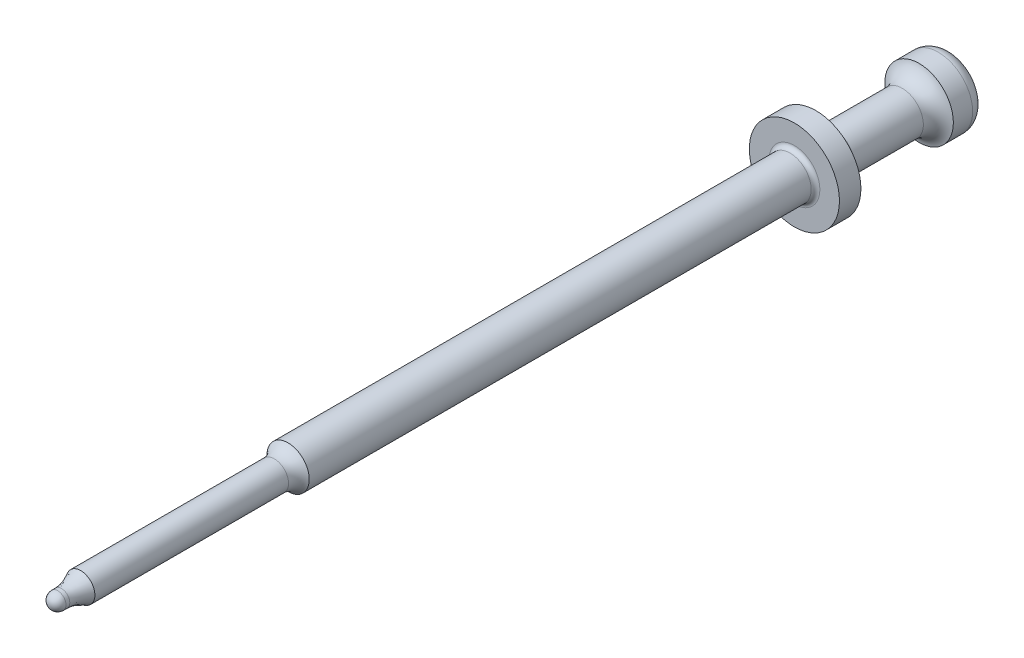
ISO-10303-21;
HEADER;
FILE_DESCRIPTION(('STEP AP214'),'2;1');
FILE_NAME('part.step','',(''),(''),'','','');
FILE_SCHEMA(('AUTOMOTIVE_DESIGN { 1 0 10303 214 1 1 1 1 }'));
ENDSEC;
DATA;
#1=APPLICATION_CONTEXT('core data for automotive mechanical design processes');
#2=APPLICATION_PROTOCOL_DEFINITION('international standard','automotive_design',2000,#1);
#3=PRODUCT_CONTEXT('',#1,'mechanical');
#4=PRODUCT('Part','Part','',(#3));
#5=PRODUCT_RELATED_PRODUCT_CATEGORY('part','',(#4));
#6=PRODUCT_DEFINITION_FORMATION('','',#4);
#7=PRODUCT_DEFINITION_CONTEXT('part definition',#1,'design');
#8=PRODUCT_DEFINITION('design','',#6,#7);
#9=PRODUCT_DEFINITION_SHAPE('','',#8);
#10=(LENGTH_UNIT() NAMED_UNIT(*) SI_UNIT(.MILLI.,.METRE.));
#11=(NAMED_UNIT(*) PLANE_ANGLE_UNIT() SI_UNIT($,.RADIAN.));
#12=(NAMED_UNIT(*) SI_UNIT($,.STERADIAN.) SOLID_ANGLE_UNIT());
#13=UNCERTAINTY_MEASURE_WITH_UNIT(LENGTH_MEASURE(1.E-05),#10,'distance_accuracy_value','');
#14=(GEOMETRIC_REPRESENTATION_CONTEXT(3) GLOBAL_UNCERTAINTY_ASSIGNED_CONTEXT((#13)) GLOBAL_UNIT_ASSIGNED_CONTEXT((#10,
#11,#12)) REPRESENTATION_CONTEXT('',''));
#15=CARTESIAN_POINT('',(0.,0.,0.));
#16=DIRECTION('',(0.,0.,1.));
#17=DIRECTION('',(1.,0.,0.));
#18=AXIS2_PLACEMENT_3D('',#15,#16,#17);
#19=CARTESIAN_POINT('',(0.,0.,82.5));
#20=DIRECTION('',(0.,-1.,0.));
#21=DIRECTION('',(1.,0.,0.));
#22=AXIS2_PLACEMENT_3D('',#19,#20,#21);
#23=SPHERICAL_SURFACE('',#22,0.765);
#24=CARTESIAN_POINT('',(0.,0.,82.5));
#25=DIRECTION('',(0.,0.,-1.));
#26=DIRECTION('',(-1.,0.,0.));
#27=AXIS2_PLACEMENT_3D('',#24,#25,#26);
#28=SPHERICAL_SURFACE('',#27,0.765);
#29=CARTESIAN_POINT('',(0.,0.,82.5));
#30=DIRECTION('',(0.,0.,-1.));
#31=DIRECTION('',(-1.,0.,0.));
#32=AXIS2_PLACEMENT_3D('',#29,#30,#31);
#33=CIRCLE('',#32,0.765);
#34=CARTESIAN_POINT('',(-0.765,0.,82.5));
#35=VERTEX_POINT('',#34);
#36=EDGE_CURVE('E11',#35,#35,#33,.T.);
#37=ORIENTED_EDGE('',*,*,#36,.F.);
#38=EDGE_LOOP('',(#37));
#39=FACE_BOUND('',#38,.T.);
#40=ADVANCED_FACE('F61',(#39),#28,.T.);
#41=CARTESIAN_POINT('',(0.,0.,14.49));
#42=DIRECTION('',(0.,0.,1.));
#43=DIRECTION('',(1.,0.,0.));
#44=AXIS2_PLACEMENT_3D('',#41,#42,#43);
#45=PLANE('',#44);
#46=CARTESIAN_POINT('',(0.,0.,14.49));
#47=DIRECTION('',(0.,0.,1.));
#48=DIRECTION('',(1.,0.,0.));
#49=AXIS2_PLACEMENT_3D('',#46,#47,#48);
#50=CIRCLE('',#49,2.35);
#51=CARTESIAN_POINT('',(2.35,0.,14.49));
#52=VERTEX_POINT('',#51);
#53=EDGE_CURVE('E71',#52,#52,#50,.F.);
#54=ORIENTED_EDGE('',*,*,#53,.T.);
#55=EDGE_LOOP('',(#54));
#56=FACE_BOUND('',#55,.T.);
#57=CARTESIAN_POINT('',(0.,0.,14.49));
#58=DIRECTION('',(0.,0.,1.));
#59=DIRECTION('',(1.,0.,0.));
#60=AXIS2_PLACEMENT_3D('',#57,#58,#59);
#61=CIRCLE('',#60,4.16);
#62=CARTESIAN_POINT('',(4.16,0.,14.49));
#63=VERTEX_POINT('',#62);
#64=EDGE_CURVE('E309',#63,#63,#61,.T.);
#65=ORIENTED_EDGE('',*,*,#64,.T.);
#66=EDGE_LOOP('',(#65));
#67=FACE_BOUND('',#66,.T.);
#68=ADVANCED_FACE('F121',(#56,#67),#45,.T.);
#69=CARTESIAN_POINT('',(0.,0.,2.98));
#70=DIRECTION('',(0.,0.,-1.));
#71=DIRECTION('',(-1.,0.,0.));
#72=AXIS2_PLACEMENT_3D('',#69,#70,#71);
#73=CYLINDRICAL_SURFACE('',#72,3.165);
#74=CARTESIAN_POINT('',(0.,0.,1.2));
#75=DIRECTION('',(0.,0.,1.));
#76=DIRECTION('',(1.,0.,0.));
#77=AXIS2_PLACEMENT_3D('',#74,#75,#76);
#78=CIRCLE('',#77,3.165);
#79=CARTESIAN_POINT('',(3.165,0.,1.2));
#80=VERTEX_POINT('',#79);
#81=EDGE_CURVE('E83',#80,#80,#78,.T.);
#82=ORIENTED_EDGE('',*,*,#81,.T.);
#83=EDGE_LOOP('',(#82));
#84=FACE_BOUND('',#83,.T.);
#85=CARTESIAN_POINT('',(0.,0.,2.98));
#86=DIRECTION('',(0.,0.,1.));
#87=DIRECTION('',(1.,0.,0.));
#88=AXIS2_PLACEMENT_3D('',#85,#86,#87);
#89=CIRCLE('',#88,3.165);
#90=CARTESIAN_POINT('',(3.165,0.,2.98));
#91=VERTEX_POINT('',#90);
#92=EDGE_CURVE('E95',#91,#91,#89,.T.);
#93=ORIENTED_EDGE('',*,*,#92,.F.);
#94=EDGE_LOOP('',(#93));
#95=FACE_BOUND('',#94,.T.);
#96=ADVANCED_FACE('F124',(#84,#95),#73,.T.);
#97=CARTESIAN_POINT('',(0.,0.,0.));
#98=DIRECTION('',(0.,0.,1.));
#99=DIRECTION('',(1.,0.,0.));
#100=AXIS2_PLACEMENT_3D('',#97,#98,#99);
#101=PLANE('',#100);
#102=CARTESIAN_POINT('',(0.,0.,0.));
#103=DIRECTION('',(0.,0.,1.));
#104=DIRECTION('',(1.,0.,0.));
#105=AXIS2_PLACEMENT_3D('',#102,#103,#104);
#106=CIRCLE('',#105,1.965);
#107=CARTESIAN_POINT('',(1.965,0.,0.));
#108=VERTEX_POINT('',#107);
#109=EDGE_CURVE('E80',#108,#108,#106,.F.);
#110=ORIENTED_EDGE('',*,*,#109,.T.);
#111=EDGE_LOOP('',(#110));
#112=FACE_BOUND('',#111,.T.);
#113=ADVANCED_FACE('F136',(#112),#101,.F.);
#114=CARTESIAN_POINT('',(0.,0.,12.51));
#115=DIRECTION('',(0.,0.,-1.));
#116=DIRECTION('',(-1.,0.,0.));
#117=AXIS2_PLACEMENT_3D('',#114,#115,#116);
#118=CYLINDRICAL_SURFACE('',#117,1.95);
#119=CARTESIAN_POINT('',(0.,0.,4.53298905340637));
#120=DIRECTION('',(0.,0.,-1.));
#121=DIRECTION('',(-1.,0.,0.));
#122=AXIS2_PLACEMENT_3D('',#119,#120,#121);
#123=CIRCLE('',#122,1.95);
#124=CARTESIAN_POINT('',(-1.95,0.,4.53298905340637));
#125=VERTEX_POINT('',#124);
#126=EDGE_CURVE('E89',#125,#125,#123,.F.);
#127=ORIENTED_EDGE('',*,*,#126,.T.);
#128=EDGE_LOOP('',(#127));
#129=FACE_BOUND('',#128,.T.);
#130=CARTESIAN_POINT('',(0.,0.,10.91));
#131=DIRECTION('',(0.,0.,1.));
#132=DIRECTION('',(1.,0.,0.));
#133=AXIS2_PLACEMENT_3D('',#130,#131,#132);
#134=CIRCLE('',#133,1.95);
#135=CARTESIAN_POINT('',(1.95,0.,10.91));
#136=VERTEX_POINT('',#135);
#137=EDGE_CURVE('E92',#136,#136,#134,.F.);
#138=ORIENTED_EDGE('',*,*,#137,.T.);
#139=EDGE_LOOP('',(#138));
#140=FACE_BOUND('',#139,.T.);
#141=ADVANCED_FACE('F129',(#129,#140),#118,.T.);
#142=CARTESIAN_POINT('',(0.,0.,12.51));
#143=DIRECTION('',(0.,0.,1.));
#144=DIRECTION('',(1.,0.,0.));
#145=AXIS2_PLACEMENT_3D('',#142,#143,#144);
#146=PLANE('',#145);
#147=CARTESIAN_POINT('',(0.,0.,12.51));
#148=DIRECTION('',(0.,0.,1.));
#149=DIRECTION('',(1.,0.,0.));
#150=AXIS2_PLACEMENT_3D('',#147,#148,#149);
#151=CIRCLE('',#150,3.55);
#152=CARTESIAN_POINT('',(3.55,0.,12.51));
#153=VERTEX_POINT('',#152);
#154=EDGE_CURVE('E86',#153,#153,#151,.T.);
#155=ORIENTED_EDGE('',*,*,#154,.T.);
#156=EDGE_LOOP('',(#155));
#157=FACE_BOUND('',#156,.T.);
#158=CARTESIAN_POINT('',(0.,0.,12.51));
#159=DIRECTION('',(0.,0.,1.));
#160=DIRECTION('',(1.,0.,0.));
#161=AXIS2_PLACEMENT_3D('',#158,#159,#160);
#162=CIRCLE('',#161,4.16);
#163=CARTESIAN_POINT('',(4.16,0.,12.51));
#164=VERTEX_POINT('',#163);
#165=EDGE_CURVE('E308',#164,#164,#162,.T.);
#166=ORIENTED_EDGE('',*,*,#165,.F.);
#167=EDGE_LOOP('',(#166));
#168=FACE_BOUND('',#167,.T.);
#169=ADVANCED_FACE('F126',(#157,#168),#146,.F.);
#170=CARTESIAN_POINT('',(0.,0.,14.49));
#171=DIRECTION('',(0.,0.,-1.));
#172=DIRECTION('',(-1.,0.,0.));
#173=AXIS2_PLACEMENT_3D('',#170,#171,#172);
#174=CYLINDRICAL_SURFACE('',#173,4.16);
#175=ORIENTED_EDGE('',*,*,#64,.F.);
#176=EDGE_LOOP('',(#175));
#177=FACE_BOUND('',#176,.T.);
#178=ORIENTED_EDGE('',*,*,#165,.T.);
#179=EDGE_LOOP('',(#178));
#180=FACE_BOUND('',#179,.T.);
#181=ADVANCED_FACE('F119',(#177,#180),#174,.T.);
#182=CARTESIAN_POINT('',(0.,0.,61.23));
#183=DIRECTION('',(0.,0.,-1.));
#184=DIRECTION('',(-1.,0.,0.));
#185=AXIS2_PLACEMENT_3D('',#182,#183,#184);
#186=CYLINDRICAL_SURFACE('',#185,1.95);
#187=CARTESIAN_POINT('',(0.,0.,14.89));
#188=DIRECTION('',(0.,0.,1.));
#189=DIRECTION('',(1.,0.,0.));
#190=AXIS2_PLACEMENT_3D('',#187,#188,#189);
#191=CIRCLE('',#190,1.95);
#192=CARTESIAN_POINT('',(1.95,0.,14.89));
#193=VERTEX_POINT('',#192);
#194=EDGE_CURVE('E75',#193,#193,#191,.T.);
#195=ORIENTED_EDGE('',*,*,#194,.T.);
#196=EDGE_LOOP('',(#195));
#197=FACE_BOUND('',#196,.T.);
#198=CARTESIAN_POINT('',(0.,0.,61.23));
#199=DIRECTION('',(0.,0.,1.));
#200=DIRECTION('',(1.,0.,0.));
#201=AXIS2_PLACEMENT_3D('',#198,#199,#200);
#202=CIRCLE('',#201,1.95);
#203=CARTESIAN_POINT('',(1.95,0.,61.23));
#204=VERTEX_POINT('',#203);
#205=EDGE_CURVE('E104',#204,#204,#202,.T.);
#206=ORIENTED_EDGE('',*,*,#205,.F.);
#207=EDGE_LOOP('',(#206));
#208=FACE_BOUND('',#207,.T.);
#209=ADVANCED_FACE('F116',(#197,#208),#186,.T.);
#210=CARTESIAN_POINT('',(0.,0.,80.38));
#211=DIRECTION('',(0.,0.,-1.));
#212=DIRECTION('',(-1.,0.,0.));
#213=AXIS2_PLACEMENT_3D('',#210,#211,#212);
#214=CYLINDRICAL_SURFACE('',#213,1.315);
#215=CARTESIAN_POINT('',(0.,0.,62.5062346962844));
#216=DIRECTION('',(0.,0.,-1.));
#217=DIRECTION('',(-1.,0.,0.));
#218=AXIS2_PLACEMENT_3D('',#215,#216,#217);
#219=CIRCLE('',#218,1.315);
#220=CARTESIAN_POINT('',(-1.315,0.,62.5062346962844));
#221=VERTEX_POINT('',#220);
#222=EDGE_CURVE('E67',#221,#221,#219,.F.);
#223=ORIENTED_EDGE('',*,*,#222,.T.);
#224=EDGE_LOOP('',(#223));
#225=FACE_BOUND('',#224,.T.);
#226=CARTESIAN_POINT('',(-0.914531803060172,-0.944910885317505,80.38));
#227=CARTESIAN_POINT('',(-0.960591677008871,-0.900330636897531,80.3799991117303));
#228=CARTESIAN_POINT('',(-1.00339430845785,-0.852368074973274,80.3801715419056));
#229=CARTESIAN_POINT('',(-1.08157394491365,-0.750693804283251,80.3804378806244));
#230=CARTESIAN_POINT('',(-1.11694576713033,-0.696978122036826,80.3805317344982));
#231=CARTESIAN_POINT('',(-1.18424180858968,-0.576414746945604,80.3805341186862));
#232=CARTESIAN_POINT('',(-1.21482421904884,-0.508812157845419,80.3804123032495));
#233=CARTESIAN_POINT('',(-1.26420851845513,-0.369422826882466,80.3800721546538));
#234=CARTESIAN_POINT('',(-1.28300709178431,-0.297634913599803,80.3798537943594));
#235=CARTESIAN_POINT('',(-1.30828496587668,-0.151926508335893,80.3795444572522));
#236=CARTESIAN_POINT('',(-1.31476543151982,-0.0780062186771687,80.3794534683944));
#237=CARTESIAN_POINT('',(-1.31522198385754,0.0698701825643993,80.379483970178));
#238=CARTESIAN_POINT('',(-1.30919883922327,0.143826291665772,80.3796054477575));
#239=CARTESIAN_POINT('',(-1.28482969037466,0.289666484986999,80.3799467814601));
#240=CARTESIAN_POINT('',(-1.26648410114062,0.361550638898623,80.3801666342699));
#241=CARTESIAN_POINT('',(-1.21796156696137,0.501252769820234,80.3804724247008));
#242=CARTESIAN_POINT('',(-1.18778451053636,0.569070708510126,80.38055836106));
#243=CARTESIAN_POINT('',(-1.13435246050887,0.666215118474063,80.3805069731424));
#244=CARTESIAN_POINT('',(-1.11516989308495,0.697846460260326,80.3804597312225));
#245=CARTESIAN_POINT('',(-1.07420465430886,0.759390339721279,80.3803296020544));
#246=CARTESIAN_POINT('',(-1.05242198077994,0.789302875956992,80.3802467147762));
#247=CARTESIAN_POINT('',(-1.00641505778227,0.847184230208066,80.3800911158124));
#248=CARTESIAN_POINT('',(-0.982190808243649,0.875153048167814,80.3800184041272));
#249=CARTESIAN_POINT('',(-0.931472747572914,0.928951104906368,80.3799902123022));
#250=CARTESIAN_POINT('',(-0.904978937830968,0.954780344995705,80.3800347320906));
#251=CARTESIAN_POINT('',(-0.849907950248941,1.00411526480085,80.3801669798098));
#252=CARTESIAN_POINT('',(-0.821330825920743,1.02762100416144,80.3802547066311));
#253=CARTESIAN_POINT('',(-0.762307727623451,1.07213825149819,80.3804043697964));
#254=CARTESIAN_POINT('',(-0.731861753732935,1.09314975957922,80.3804663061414));
#255=CARTESIAN_POINT('',(-0.638032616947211,1.15221006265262,80.3805661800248));
#256=CARTESIAN_POINT('',(-0.572108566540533,1.18632905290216,80.3805184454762));
#257=CARTESIAN_POINT('',(-0.435503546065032,1.24299550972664,80.3802558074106));
#258=CARTESIAN_POINT('',(-0.364822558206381,1.26554293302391,80.3800409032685));
#259=CARTESIAN_POINT('',(-0.220668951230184,1.29845778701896,80.3796771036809));
#260=CARTESIAN_POINT('',(-0.147196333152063,1.30882522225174,80.379528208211));
#261=CARTESIAN_POINT('',(0.000448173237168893,1.31707747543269,80.3794377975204));
#262=CARTESIAN_POINT('',(0.0746200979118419,1.31496164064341,80.3794962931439));
#263=CARTESIAN_POINT('',(0.221556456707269,1.2983082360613,80.3797656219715));
#264=CARTESIAN_POINT('',(0.294320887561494,1.28377063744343,80.3799764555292));
#265=CARTESIAN_POINT('',(0.436374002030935,1.24268636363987,80.3803417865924));
#266=CARTESIAN_POINT('',(0.505662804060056,1.21614009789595,80.3804962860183));
#267=CARTESIAN_POINT('',(0.638800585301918,1.15179223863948,80.380554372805));
#268=CARTESIAN_POINT('',(0.7026495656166,1.11399064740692,80.3804579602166));
#269=CARTESIAN_POINT('',(0.823092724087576,1.0282069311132,80.3801722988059));
#270=CARTESIAN_POINT('',(0.879687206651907,0.980225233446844,80.3799830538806));
#271=CARTESIAN_POINT('',(0.984018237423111,0.875442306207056,80.3800337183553));
#272=CARTESIAN_POINT('',(1.03175478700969,0.818641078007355,80.3802736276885));
#273=CARTESIAN_POINT('',(1.11701638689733,0.697829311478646,80.3805403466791));
#274=CARTESIAN_POINT('',(1.15454117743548,0.633818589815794,80.3805671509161));
#275=CARTESIAN_POINT('',(1.2183123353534,0.500406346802,80.3804091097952));
#276=CARTESIAN_POINT('',(1.24455869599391,0.431004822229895,80.3802242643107));
#277=CARTESIAN_POINT('',(1.28502762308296,0.288781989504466,80.3798467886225));
#278=CARTESIAN_POINT('',(1.29925044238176,0.215960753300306,80.3796541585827));
#279=CARTESIAN_POINT('',(1.31527008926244,0.0689644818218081,80.3794512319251));
#280=CARTESIAN_POINT('',(1.31706694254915,-0.00521055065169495,80.3794409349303));
#281=CARTESIAN_POINT('',(1.30818133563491,-0.152813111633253,80.3796116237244));
#282=CARTESIAN_POINT('',(1.29749861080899,-0.226240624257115,80.3797926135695));
#283=CARTESIAN_POINT('',(1.26396517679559,-0.370251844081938,80.3801716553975));
#284=CARTESIAN_POINT('',(1.24111447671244,-0.440835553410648,80.3803697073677));
#285=CARTESIAN_POINT('',(1.18386036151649,-0.577200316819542,80.3805574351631));
#286=CARTESIAN_POINT('',(1.14945630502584,-0.642981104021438,80.380547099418));
#287=CARTESIAN_POINT('',(1.08998900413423,-0.736560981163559,80.3803863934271));
#288=CARTESIAN_POINT('',(1.06884518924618,-0.766918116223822,80.3803085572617));
#289=CARTESIAN_POINT('',(1.02407167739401,-0.825752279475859,80.3801467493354));
#290=CARTESIAN_POINT('',(1.00044198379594,-0.85422931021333,80.380062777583));
#291=CARTESIAN_POINT('',(0.950867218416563,-0.909089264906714,80.3799912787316));
#292=CARTESIAN_POINT('',(0.924922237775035,-0.935472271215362,80.380003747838));
#293=CARTESIAN_POINT('',(0.870911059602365,-0.985955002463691,80.3801050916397));
#294=CARTESIAN_POINT('',(0.842844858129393,-1.01005472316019,80.3801939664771));
#295=CARTESIAN_POINT('',(0.755750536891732,-1.07866362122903,80.3804285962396));
#296=CARTESIAN_POINT('',(0.693781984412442,-1.11953192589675,80.3805425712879));
#297=CARTESIAN_POINT('',(0.563896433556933,-1.19026135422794,80.3805209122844));
#298=CARTESIAN_POINT('',(0.495979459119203,-1.22012252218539,80.3803852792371));
#299=CARTESIAN_POINT('',(0.356089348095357,-1.26802513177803,80.380033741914));
#300=CARTESIAN_POINT('',(0.284116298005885,-1.28606682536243,80.3798178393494));
#301=CARTESIAN_POINT('',(0.138166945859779,-1.3098100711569,80.3795236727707));
#302=CARTESIAN_POINT('',(0.0641906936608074,-1.31551193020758,80.3794454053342));
#303=CARTESIAN_POINT('',(-0.0836816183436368,-1.314415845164,80.3795000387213));
#304=CARTESIAN_POINT('',(-0.157577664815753,-1.30761607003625,80.3796329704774));
#305=CARTESIAN_POINT('',(-0.30319062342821,-1.28170673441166,80.3799843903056));
#306=CARTESIAN_POINT('',(-0.374907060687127,-1.26259451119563,80.3802028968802));
#307=CARTESIAN_POINT('',(-0.514077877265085,-1.21260362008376,80.3804930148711));
#308=CARTESIAN_POINT('',(-0.581535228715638,-1.18173326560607,80.3805647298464));
#309=CARTESIAN_POINT('',(-0.694717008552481,-1.11791777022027,80.3804792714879));
#310=CARTESIAN_POINT('',(-0.741756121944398,-1.08727341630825,80.3803731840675));
#311=CARTESIAN_POINT('',(-0.831535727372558,-1.0202494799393,80.380133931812));
#312=CARTESIAN_POINT('',(-0.874277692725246,-0.983871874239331,80.3800007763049));
#313=CARTESIAN_POINT('',(-0.914531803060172,-0.944910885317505,80.38));
#314=B_SPLINE_CURVE_WITH_KNOTS('',3,(#226,#227,#228,#229,#230,#231,#232,#233,#234,#235,#236,
#237,#238,#239,#240,#241,#242,#243,#244,#245,#246,#247,#248,#249,#250,#251,#252,#253,#254,#255,
#256,#257,#258,#259,#260,#261,#262,#263,#264,#265,#266,#267,#268,#269,#270,#271,#272,#273,#274,
#275,#276,#277,#278,#279,#280,#281,#282,#283,#284,#285,#286,#287,#288,#289,#290,#291,#292,#293,
#294,#295,#296,#297,#298,#299,#300,#301,#302,#303,#304,#305,#306,#307,#308,#309,#310,#311,#312,
#313),.UNSPECIFIED.,.T.,.F.,(4,2,2,2,2,2,2,2,2,2,2,2,2,2,2,2,2,2,2,2,2,2,2,2,2,2,2,2,2,2,2,2,2,
2,2,2,2,2,2,2,2,2,2,4),(0.,0.192148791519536,0.384431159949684,0.605947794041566,
0.827526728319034,1.04908470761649,1.27062906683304,1.49216596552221,1.71370495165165,
1.82457745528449,1.9354500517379,2.04632265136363,2.15719518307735,2.26806486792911,
2.37893454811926,2.60047652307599,2.82201932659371,3.04356204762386,3.26511635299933,
3.48667117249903,3.70821843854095,3.9297656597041,4.15130358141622,4.37284146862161,
4.59438499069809,4.81592864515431,5.03746764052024,5.25900617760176,5.4805494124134,
5.70209248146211,5.92364785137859,6.03452441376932,6.14540082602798,6.25627287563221,
6.36714513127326,6.58869228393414,6.81023854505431,7.03178008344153,7.25331611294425,
7.47488459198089,7.69650100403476,7.91796101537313,8.08594759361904,8.25387637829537),.UNSPECIFIED.);
#315=CARTESIAN_POINT('',(0.914531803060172,0.944910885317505,80.38));
#316=VERTEX_POINT('',#315);
#317=EDGE_CURVE('E96',#316,#316,#314,.F.);
#318=ORIENTED_EDGE('',*,*,#317,.F.);
#319=EDGE_LOOP('',(#318));
#320=FACE_BOUND('',#319,.T.);
#321=ADVANCED_FACE('F112',(#225,#320),#214,.T.);
#322=CARTESIAN_POINT('',(0.455082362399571,0.61491872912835,82.15));
#323=CARTESIAN_POINT('',(0.455082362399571,0.61491872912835,81.5306016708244));
#324=CARTESIAN_POINT('',(0.684807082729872,0.779914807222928,80.9553008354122));
#325=CARTESIAN_POINT('',(0.914531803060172,0.944910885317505,80.38));
#326=CARTESIAN_POINT('',(0.916829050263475,0.946560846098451,80.3742469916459));
#327=CARTESIAN_POINT('',(0.919126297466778,0.948210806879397,80.3684939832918));
#328=CARTESIAN_POINT('',(0.921423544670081,0.949860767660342,80.3627409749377));
#329=CARTESIAN_POINT('',(0.47205150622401,0.602360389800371,82.15));
#330=CARTESIAN_POINT('',(0.47205150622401,0.602360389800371,81.5306016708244));
#331=CARTESIAN_POINT('',(0.706329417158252,0.761017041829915,80.9553008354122));
#332=CARTESIAN_POINT('',(0.940607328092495,0.919673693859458,80.38));
#333=CARTESIAN_POINT('',(0.942950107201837,0.921260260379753,80.3742469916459));
#334=CARTESIAN_POINT('',(0.945292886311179,0.922846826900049,80.3684939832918));
#335=CARTESIAN_POINT('',(0.947635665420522,0.924433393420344,80.3627409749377));
#336=CARTESIAN_POINT('',(0.504650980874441,0.576102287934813,82.15));
#337=CARTESIAN_POINT('',(0.504650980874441,0.576102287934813,81.5305992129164));
#338=CARTESIAN_POINT('',(0.747434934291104,0.721829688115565,80.9552996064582));
#339=CARTESIAN_POINT('',(0.990218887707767,0.867557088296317,80.38));
#340=CARTESIAN_POINT('',(0.992646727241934,0.869014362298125,80.3742470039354));
#341=CARTESIAN_POINT('',(0.9950745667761,0.870471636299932,80.3684940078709));
#342=CARTESIAN_POINT('',(0.997502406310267,0.87192891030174,80.3627410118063));
#343=CARTESIAN_POINT('',(0.549492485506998,0.533567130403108,82.15));
#344=CARTESIAN_POINT('',(0.549492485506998,0.533567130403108,81.5305940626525));
#345=CARTESIAN_POINT('',(0.803251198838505,0.659251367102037,80.9552970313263));
#346=CARTESIAN_POINT('',(1.05700991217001,0.784935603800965,80.38));
#347=CARTESIAN_POINT('',(1.05954749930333,0.786192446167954,80.3742470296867));
#348=CARTESIAN_POINT('',(1.06208508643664,0.787449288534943,80.3684940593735));
#349=CARTESIAN_POINT('',(1.06462267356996,0.788706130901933,80.3627410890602));
#350=CARTESIAN_POINT('',(0.590235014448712,0.48816023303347,82.15));
#351=CARTESIAN_POINT('',(0.590235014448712,0.48816023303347,81.5305904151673));
#352=CARTESIAN_POINT('',(0.853200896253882,0.593253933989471,80.9552952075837));
#353=CARTESIAN_POINT('',(1.11616677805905,0.698347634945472,80.38));
#354=CARTESIAN_POINT('',(1.1187964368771,0.699398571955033,80.3742470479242));
#355=CARTESIAN_POINT('',(1.12142609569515,0.700449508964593,80.3684940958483));
#356=CARTESIAN_POINT('',(1.12405575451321,0.701500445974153,80.3627411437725));
#357=CARTESIAN_POINT('',(0.809848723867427,0.200145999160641,82.15));
#358=CARTESIAN_POINT('',(0.809848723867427,0.200145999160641,81.5305914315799));
#359=CARTESIAN_POINT('',(1.1175523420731,0.179023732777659,80.95529571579));
#360=CARTESIAN_POINT('',(1.42525596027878,0.157901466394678,80.38));
#361=CARTESIAN_POINT('',(1.42833299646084,0.157690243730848,80.3742470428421));
#362=CARTESIAN_POINT('',(1.4314100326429,0.157479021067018,80.3684940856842));
#363=CARTESIAN_POINT('',(1.43448706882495,0.157267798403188,80.3627411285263));
#364=CARTESIAN_POINT('',(0.81585215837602,-0.183576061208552,82.15));
#365=CARTESIAN_POINT('',(0.81585215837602,-0.183576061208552,81.5305989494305));
#366=CARTESIAN_POINT('',(1.08227905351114,-0.34044973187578,80.9552994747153));
#367=CARTESIAN_POINT('',(1.34870594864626,-0.497323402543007,80.38));
#368=CARTESIAN_POINT('',(1.35137021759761,-0.49889213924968,80.3742470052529));
#369=CARTESIAN_POINT('',(1.35403448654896,-0.500460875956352,80.3684940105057));
#370=CARTESIAN_POINT('',(1.35669875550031,-0.502029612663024,80.3627410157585));
#371=CARTESIAN_POINT('',(0.363751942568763,-0.794465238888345,82.15));
#372=CARTESIAN_POINT('',(0.363751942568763,-0.794465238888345,81.5306050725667));
#373=CARTESIAN_POINT('',(0.401959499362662,-1.11525377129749,80.9553025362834));
#374=CARTESIAN_POINT('',(0.44016705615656,-1.43604230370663,80.38));
#375=CARTESIAN_POINT('',(0.440549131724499,-1.43925018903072,80.3742469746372));
#376=CARTESIAN_POINT('',(0.440931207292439,-1.44245807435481,80.3684939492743));
#377=CARTESIAN_POINT('',(0.441313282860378,-1.4456659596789,80.3627409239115));
#378=CARTESIAN_POINT('',(-0.115699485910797,-0.866085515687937,82.15));
#379=CARTESIAN_POINT('',(-0.115699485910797,-0.866085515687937,81.5306016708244));
#380=CARTESIAN_POINT('',(-0.254360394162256,-1.15787011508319,80.9553008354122));
#381=CARTESIAN_POINT('',(-0.393021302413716,-1.44965471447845,80.38));
#382=CARTESIAN_POINT('',(-0.39440791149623,-1.4525725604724,80.3742469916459));
#383=CARTESIAN_POINT('',(-0.395794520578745,-1.45549040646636,80.3684939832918));
#384=CARTESIAN_POINT('',(-0.397181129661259,-1.45840825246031,80.3627409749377));
#385=CARTESIAN_POINT('',(-0.794465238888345,-0.363751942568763,82.15));
#386=CARTESIAN_POINT('',(-0.794465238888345,-0.363751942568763,81.5306016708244));
#387=CARTESIAN_POINT('',(-1.11525377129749,-0.401959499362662,80.9553008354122));
#388=CARTESIAN_POINT('',(-1.43604230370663,-0.44016705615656,80.38));
#389=CARTESIAN_POINT('',(-1.43925018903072,-0.440549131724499,80.3742469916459));
#390=CARTESIAN_POINT('',(-1.44245807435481,-0.440931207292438,80.3684939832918));
#391=CARTESIAN_POINT('',(-1.4456659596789,-0.441313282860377,80.3627409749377));
#392=CARTESIAN_POINT('',(-0.866085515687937,0.115699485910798,82.15));
#393=CARTESIAN_POINT('',(-0.866085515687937,0.115699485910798,81.5306050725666));
#394=CARTESIAN_POINT('',(-1.15787011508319,0.254360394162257,80.9553025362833));
#395=CARTESIAN_POINT('',(-1.44965471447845,0.393021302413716,80.38));
#396=CARTESIAN_POINT('',(-1.4525725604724,0.394407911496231,80.3742469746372));
#397=CARTESIAN_POINT('',(-1.45549040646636,0.395794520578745,80.3684939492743));
#398=CARTESIAN_POINT('',(-1.45840825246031,0.39718112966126,80.3627409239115));
#399=CARTESIAN_POINT('',(-0.413985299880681,0.72658866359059,82.15));
#400=CARTESIAN_POINT('',(-0.413985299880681,0.72658866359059,81.5305989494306));
#401=CARTESIAN_POINT('',(-0.477550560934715,1.02916443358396,80.9552994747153));
#402=CARTESIAN_POINT('',(-0.541115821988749,1.33174020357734,80.38));
#403=CARTESIAN_POINT('',(-0.54175147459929,1.33476596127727,80.3742470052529));
#404=CARTESIAN_POINT('',(-0.54238712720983,1.3377917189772,80.3684940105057));
#405=CARTESIAN_POINT('',(-0.54302277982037,1.34081747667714,80.3627410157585));
#406=CARTESIAN_POINT('',(-0.0452599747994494,0.832985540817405,82.15));
#407=CARTESIAN_POINT('',(-0.0452599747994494,0.832985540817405,81.5305914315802));
#408=CARTESIAN_POINT('',(0.0329993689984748,1.13131948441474,80.9552957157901));
#409=CARTESIAN_POINT('',(0.111258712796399,1.42965342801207,80.38));
#410=CARTESIAN_POINT('',(0.112041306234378,1.43263676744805,80.3742470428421));
#411=CARTESIAN_POINT('',(0.112823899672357,1.43562010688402,80.3684940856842));
#412=CARTESIAN_POINT('',(0.113606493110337,1.43860344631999,80.3627411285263));
#413=CARTESIAN_POINT('',(0.294360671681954,0.707127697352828,82.15));
#414=CARTESIAN_POINT('',(0.294360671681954,0.707127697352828,81.5305904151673));
#415=CARTESIAN_POINT('',(0.477937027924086,0.922755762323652,80.9552952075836));
#416=CARTESIAN_POINT('',(0.661513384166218,1.13838382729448,80.38));
#417=CARTESIAN_POINT('',(0.663349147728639,1.14054010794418,80.3742470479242));
#418=CARTESIAN_POINT('',(0.66518491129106,1.14269638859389,80.3684940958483));
#419=CARTESIAN_POINT('',(0.667020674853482,1.1448526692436,80.3627411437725));
#420=CARTESIAN_POINT('',(0.349691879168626,0.681433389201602,82.15));
#421=CARTESIAN_POINT('',(0.349691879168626,0.681433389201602,81.5305940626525));
#422=CARTESIAN_POINT('',(0.549839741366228,0.881760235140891,80.9552970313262));
#423=CARTESIAN_POINT('',(0.74998760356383,1.08208708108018,80.38));
#424=CARTESIAN_POINT('',(0.751989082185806,1.08409034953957,80.3742470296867));
#425=CARTESIAN_POINT('',(0.753990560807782,1.08609361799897,80.3684940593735));
#426=CARTESIAN_POINT('',(0.755992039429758,1.08809688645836,80.3627410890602));
#427=CARTESIAN_POINT('',(0.403474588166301,0.650979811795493,82.15));
#428=CARTESIAN_POINT('',(0.403474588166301,0.650979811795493,81.5305992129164));
#429=CARTESIAN_POINT('',(0.619110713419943,0.834505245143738,80.9552996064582));
#430=CARTESIAN_POINT('',(0.834746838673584,1.01803067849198,80.38));
#431=CARTESIAN_POINT('',(0.836903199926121,1.01986593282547,80.3742470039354));
#432=CARTESIAN_POINT('',(0.839059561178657,1.02170118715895,80.3684940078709));
#433=CARTESIAN_POINT('',(0.841215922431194,1.02353644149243,80.3627410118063));
#434=CARTESIAN_POINT('',(0.438113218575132,0.62747706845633,82.15));
#435=CARTESIAN_POINT('',(0.438113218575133,0.62747706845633,81.5306016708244));
#436=CARTESIAN_POINT('',(0.663284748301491,0.798812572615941,80.9553008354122));
#437=CARTESIAN_POINT('',(0.888456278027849,0.970148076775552,80.38));
#438=CARTESIAN_POINT('',(0.890707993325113,0.971861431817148,80.3742469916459));
#439=CARTESIAN_POINT('',(0.892959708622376,0.973574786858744,80.3684939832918));
#440=CARTESIAN_POINT('',(0.89521142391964,0.975288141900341,80.3627409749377));
#441=CARTESIAN_POINT('',(0.455082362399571,0.61491872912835,82.15));
#442=CARTESIAN_POINT('',(0.455082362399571,0.61491872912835,81.5306016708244));
#443=CARTESIAN_POINT('',(0.684807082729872,0.779914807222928,80.9553008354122));
#444=CARTESIAN_POINT('',(0.914531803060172,0.944910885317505,80.38));
#445=CARTESIAN_POINT('',(0.916829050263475,0.946560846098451,80.3742469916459));
#446=CARTESIAN_POINT('',(0.919126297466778,0.948210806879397,80.3684939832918));
#447=CARTESIAN_POINT('',(0.921423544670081,0.949860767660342,80.3627409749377));
#448=B_SPLINE_SURFACE_WITH_KNOTS('',3,3,((#322,#323,#324,#325,#326,#327,#328),(#329,#330,#331,
#332,#333,#334,#335),(#336,#337,#338,#339,#340,#341,#342),(#343,#344,#345,#346,#347,#348,#349),
(#350,#351,#352,#353,#354,#355,#356),(#357,#358,#359,#360,#361,#362,#363),(#364,#365,#366,#367,
#368,#369,#370),(#371,#372,#373,#374,#375,#376,#377),(#378,#379,#380,#381,#382,#383,#384),(#385,
#386,#387,#388,#389,#390,#391),(#392,#393,#394,#395,#396,#397,#398),(#399,#400,#401,#402,#403,
#404,#405),(#406,#407,#408,#409,#410,#411,#412),(#413,#414,#415,#416,#417,#418,#419),(#420,#421,
#422,#423,#424,#425,#426),(#427,#428,#429,#430,#431,#432,#433),(#434,#435,#436,#437,#438,#439,
#440),(#441,#442,#443,#444,#445,#446,#447)),.UNSPECIFIED.,.T.,.F.,.F.,(4,1,1,1,1,2,2,2,1,1,1,1,
4),(4,3,4),(0.,0.0125,0.0249999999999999,0.0375000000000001,0.05,0.25,0.5,0.75,0.95,0.9625,
0.975,0.9875,1.),(0.,1.,1.01),.UNSPECIFIED.);
#449=CARTESIAN_POINT('',(0.,0.,82.15));
#450=DIRECTION('',(0.,0.,1.));
#451=DIRECTION('',(1.,0.,0.));
#452=AXIS2_PLACEMENT_3D('',#449,#450,#451);
#453=CIRCLE('',#452,0.765);
#454=CARTESIAN_POINT('',(0.455082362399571,0.61491872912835,82.15));
#455=VERTEX_POINT('',#454);
#456=EDGE_CURVE('E105',#455,#455,#453,.T.);
#457=CARTESIAN_POINT('',(0.455082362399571,0.61491872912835,82.15));
#458=CARTESIAN_POINT('',(0.45508234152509,0.614918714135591,82.1403322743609));
#459=CARTESIAN_POINT('',(0.455138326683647,0.614958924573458,82.1306645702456));
#460=CARTESIAN_POINT('',(0.455360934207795,0.615118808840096,82.1113503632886));
#461=CARTESIAN_POINT('',(0.455527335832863,0.615238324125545,82.1017038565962));
#462=CARTESIAN_POINT('',(0.455969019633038,0.61555555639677,82.0824317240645));
#463=CARTESIAN_POINT('',(0.456244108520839,0.615753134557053,82.0728060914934));
#464=CARTESIAN_POINT('',(0.456901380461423,0.616225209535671,82.0535753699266));
#465=CARTESIAN_POINT('',(0.457283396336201,0.616499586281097,82.0439702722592));
#466=CARTESIAN_POINT('',(0.458152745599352,0.617123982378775,82.0247802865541));
#467=CARTESIAN_POINT('',(0.458639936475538,0.617473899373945,82.0151953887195));
#468=CARTESIAN_POINT('',(0.459717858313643,0.618248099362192,81.9960454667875));
#469=CARTESIAN_POINT('',(0.46030846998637,0.61867229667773,81.9864804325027));
#470=CARTESIAN_POINT('',(0.461591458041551,0.61959378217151,81.967369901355));
#471=CARTESIAN_POINT('',(0.462283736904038,0.620091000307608,81.95782439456));
#472=CARTESIAN_POINT('',(0.463768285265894,0.621157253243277,81.9387525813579));
#473=CARTESIAN_POINT('',(0.464560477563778,0.621726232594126,81.9292262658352));
#474=CARTESIAN_POINT('',(0.466243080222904,0.622934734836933,81.9101924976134));
#475=CARTESIAN_POINT('',(0.46713343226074,0.623574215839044,81.9006850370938));
#476=CARTESIAN_POINT('',(0.469010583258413,0.624922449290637,81.8816886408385));
#477=CARTESIAN_POINT('',(0.469997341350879,0.62563117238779,81.8721996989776));
#478=CARTESIAN_POINT('',(0.472065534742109,0.627116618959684,81.8532400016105));
#479=CARTESIAN_POINT('',(0.473146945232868,0.627893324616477,81.8437692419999));
#480=CARTESIAN_POINT('',(0.475402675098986,0.62951346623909,81.8248455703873));
#481=CARTESIAN_POINT('',(0.476576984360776,0.630356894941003,81.8153926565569));
#482=CARTESIAN_POINT('',(0.479016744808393,0.632109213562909,81.7965043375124));
#483=CARTESIAN_POINT('',(0.480282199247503,0.633018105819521,81.7870689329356));
#484=CARTESIAN_POINT('',(0.48290248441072,0.63490008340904,81.7682152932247));
#485=CARTESIAN_POINT('',(0.484257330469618,0.635873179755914,81.7587970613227));
#486=CARTESIAN_POINT('',(0.487054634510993,0.637882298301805,81.7399774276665));
#487=CARTESIAN_POINT('',(0.488497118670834,0.63891833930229,81.7305760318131));
#488=CARTESIAN_POINT('',(0.491467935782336,0.641052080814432,81.711789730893));
#489=CARTESIAN_POINT('',(0.492996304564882,0.642149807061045,81.7024048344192));
#490=CARTESIAN_POINT('',(0.496137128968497,0.644405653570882,81.6836511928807));
#491=CARTESIAN_POINT('',(0.497749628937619,0.645563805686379,81.6742824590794));
#492=CARTESIAN_POINT('',(0.501056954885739,0.647939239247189,81.6555608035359));
#493=CARTESIAN_POINT('',(0.502751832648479,0.649156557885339,81.6462078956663));
#494=CARTESIAN_POINT('',(0.506222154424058,0.651649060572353,81.6275175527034));
#495=CARTESIAN_POINT('',(0.507997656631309,0.652924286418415,81.6181801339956));
#496=CARTESIAN_POINT('',(0.511627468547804,0.655531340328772,81.5995204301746));
#497=CARTESIAN_POINT('',(0.513481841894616,0.656863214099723,81.5901981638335));
#498=CARTESIAN_POINT('',(0.51726763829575,0.659582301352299,81.571568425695));
#499=CARTESIAN_POINT('',(0.519199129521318,0.660969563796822,81.5622609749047));
#500=CARTESIAN_POINT('',(0.52313740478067,0.663798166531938,81.5436605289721));
#501=CARTESIAN_POINT('',(0.525144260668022,0.665239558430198,81.5343675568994));
#502=CARTESIAN_POINT('',(0.529231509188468,0.668175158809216,81.5157957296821));
#503=CARTESIAN_POINT('',(0.531311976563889,0.669669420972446,81.5065168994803));
#504=CARTESIAN_POINT('',(0.53554469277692,0.672709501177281,81.4879730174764));
#505=CARTESIAN_POINT('',(0.537697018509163,0.674255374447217,81.4787079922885));
#506=CARTESIAN_POINT('',(0.542071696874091,0.677397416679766,81.4601913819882));
#507=CARTESIAN_POINT('',(0.544294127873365,0.678993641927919,81.4509398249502));
#508=CARTESIAN_POINT('',(0.548807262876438,0.682235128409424,81.4324498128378));
#509=CARTESIAN_POINT('',(0.551098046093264,0.683880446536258,81.4232113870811));
#510=CARTESIAN_POINT('',(0.555746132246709,0.687218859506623,81.4047472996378));
#511=CARTESIAN_POINT('',(0.558103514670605,0.688912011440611,81.3955216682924));
#512=CARTESIAN_POINT('',(0.56288304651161,0.692344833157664,81.3770828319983));
#513=CARTESIAN_POINT('',(0.56530527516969,0.694084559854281,81.3678696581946));
#514=CARTESIAN_POINT('',(0.570212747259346,0.697609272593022,81.3494553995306));
#515=CARTESIAN_POINT('',(0.57269806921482,0.69939431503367,81.3402543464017));
#516=CARTESIAN_POINT('',(0.577729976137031,0.70300840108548,81.3218639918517));
#517=CARTESIAN_POINT('',(0.580276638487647,0.704837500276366,81.3126747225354));
#518=CARTESIAN_POINT('',(0.585429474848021,0.708538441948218,81.294307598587));
#519=CARTESIAN_POINT('',(0.58803572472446,0.710410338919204,81.2851297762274));
#520=CARTESIAN_POINT('',(0.59330598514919,0.714195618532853,81.2667852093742));
#521=CARTESIAN_POINT('',(0.595970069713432,0.71610905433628,81.2576184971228));
#522=CARTESIAN_POINT('',(0.601354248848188,0.719976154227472,81.2392958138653));
#523=CARTESIAN_POINT('',(0.604074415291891,0.721929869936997,81.2301398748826));
#524=CARTESIAN_POINT('',(0.609569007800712,0.72587627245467,81.211838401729));
#525=CARTESIAN_POINT('',(0.612343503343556,0.727869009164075,81.2026928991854));
#526=CARTESIAN_POINT('',(0.61794500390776,0.731892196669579,81.1844119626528));
#527=CARTESIAN_POINT('',(0.620772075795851,0.733922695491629,81.1752765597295));
#528=CARTESIAN_POINT('',(0.626476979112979,0.738020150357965,81.1570154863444));
#529=CARTESIAN_POINT('',(0.629354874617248,0.740087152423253,81.1478898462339));
#530=CARTESIAN_POINT('',(0.635159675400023,0.744256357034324,81.1296479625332));
#531=CARTESIAN_POINT('',(0.638086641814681,0.746358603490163,81.1205317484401));
#532=CARTESIAN_POINT('',(0.643987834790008,0.750597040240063,81.1023083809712));
#533=CARTESIAN_POINT('',(0.646962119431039,0.752733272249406,81.0932012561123));
#534=CARTESIAN_POINT('',(0.652956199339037,0.757038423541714,81.0749957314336));
#535=CARTESIAN_POINT('',(0.655976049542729,0.759207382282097,81.0658973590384));
#536=CARTESIAN_POINT('',(0.662059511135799,0.763576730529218,81.0477090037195));
#537=CARTESIAN_POINT('',(0.665123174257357,0.76577715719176,81.0386190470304));
#538=CARTESIAN_POINT('',(0.6712925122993,0.770208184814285,81.0204471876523));
#539=CARTESIAN_POINT('',(0.674398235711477,0.772438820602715,81.0113653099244));
#540=CARTESIAN_POINT('',(0.680649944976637,0.776929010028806,80.9932092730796));
#541=CARTESIAN_POINT('',(0.683795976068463,0.779188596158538,80.9841351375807));
#542=CARTESIAN_POINT('',(0.690126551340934,0.783735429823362,80.9659942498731));
#543=CARTESIAN_POINT('',(0.693311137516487,0.786022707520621,80.9569275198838));
#544=CARTESIAN_POINT('',(0.699717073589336,0.790623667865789,80.9388011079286));
#545=CARTESIAN_POINT('',(0.702938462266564,0.792937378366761,80.9297414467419));
#546=CARTESIAN_POINT('',(0.709416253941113,0.797589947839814,80.9116288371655));
#547=CARTESIAN_POINT('',(0.712672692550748,0.799928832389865,80.9025759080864));
#548=CARTESIAN_POINT('',(0.7192188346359,0.804630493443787,80.8844764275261));
#549=CARTESIAN_POINT('',(0.722508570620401,0.80699329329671,80.8754298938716));
#550=CARTESIAN_POINT('',(0.729119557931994,0.811741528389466,80.8573428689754));
#551=CARTESIAN_POINT('',(0.732440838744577,0.814126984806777,80.8483023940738));
#552=CARTESIAN_POINT('',(0.73911316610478,0.81891927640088,80.8302271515));
#553=CARTESIAN_POINT('',(0.742464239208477,0.821326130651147,80.8211923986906));
#554=CARTESIAN_POINT('',(0.74919440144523,0.826159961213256,80.8031282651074));
#555=CARTESIAN_POINT('',(0.752573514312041,0.828586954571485,80.7940988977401));
#556=CARTESIAN_POINT('',(0.75935800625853,0.833459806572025,80.7760451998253));
#557=CARTESIAN_POINT('',(0.762763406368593,0.83590568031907,80.76702088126));
#558=CARTESIAN_POINT('',(0.76959872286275,0.840815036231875,80.7489769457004));
#559=CARTESIAN_POINT('',(0.773028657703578,0.843278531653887,80.7399573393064));
#560=CARTESIAN_POINT('',(0.779911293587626,0.848221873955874,80.7219224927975));
#561=CARTESIAN_POINT('',(0.783364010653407,0.850701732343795,80.7129072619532));
#562=CARTESIAN_POINT('',(0.790290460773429,0.855676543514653,80.6948808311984));
#563=CARTESIAN_POINT('',(0.793764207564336,0.858171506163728,80.6858696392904));
#564=CARTESIAN_POINT('',(0.800730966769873,0.863175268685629,80.667850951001));
#565=CARTESIAN_POINT('',(0.804223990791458,0.865684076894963,80.6588434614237));
#566=CARTESIAN_POINT('',(0.811227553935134,0.870714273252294,80.6408318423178));
#567=CARTESIAN_POINT('',(0.814738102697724,0.873235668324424,80.6318277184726));
#568=CARTESIAN_POINT('',(0.8217749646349,0.878289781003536,80.6138224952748));
#569=CARTESIAN_POINT('',(0.825301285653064,0.880822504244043,80.6048214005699));
#570=CARTESIAN_POINT('',(0.832367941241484,0.885898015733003,80.5868219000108));
#571=CARTESIAN_POINT('',(0.835908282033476,0.888440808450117,80.57782349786));
#572=CARTESIAN_POINT('',(0.843001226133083,0.893535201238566,80.5598290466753));
#573=CARTESIAN_POINT('',(0.846553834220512,0.896086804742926,80.5508330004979));
#574=CARTESIAN_POINT('',(0.853669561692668,0.901197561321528,80.5328429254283));
#575=CARTESIAN_POINT('',(0.857232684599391,0.903756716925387,80.5238488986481));
#576=CARTESIAN_POINT('',(0.864367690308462,0.908881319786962,80.5058625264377));
#577=CARTESIAN_POINT('',(0.867939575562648,0.911446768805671,80.496870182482));
#578=CARTESIAN_POINT('',(0.875090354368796,0.916582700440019,80.4788868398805));
#579=CARTESIAN_POINT('',(0.878669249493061,0.919153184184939,80.4698958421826));
#580=CARTESIAN_POINT('',(0.88583229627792,0.924297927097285,80.4519148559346));
#581=CARTESIAN_POINT('',(0.889416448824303,0.926872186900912,80.4429248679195));
#582=CARTESIAN_POINT('',(0.896588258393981,0.932023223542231,80.4249455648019));
#583=CARTESIAN_POINT('',(0.900175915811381,0.934600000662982,80.4159562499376));
#584=CARTESIAN_POINT('',(0.907352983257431,0.939754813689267,80.3979779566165));
#585=CARTESIAN_POINT('',(0.910942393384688,0.942332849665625,80.3889889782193));
#586=CARTESIAN_POINT('',(0.914531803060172,0.944910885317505,80.38));
#587=B_SPLINE_CURVE_WITH_KNOTS('',3,(#457,#458,#459,#460,#461,#462,#463,#464,#465,#466,#467,
#468,#469,#470,#471,#472,#473,#474,#475,#476,#477,#478,#479,#480,#481,#482,#483,#484,#485,#486,
#487,#488,#489,#490,#491,#492,#493,#494,#495,#496,#497,#498,#499,#500,#501,#502,#503,#504,#505,
#506,#507,#508,#509,#510,#511,#512,#513,#514,#515,#516,#517,#518,#519,#520,#521,#522,#523,#524,
#525,#526,#527,#528,#529,#530,#531,#532,#533,#534,#535,#536,#537,#538,#539,#540,#541,#542,#543,
#544,#545,#546,#547,#548,#549,#550,#551,#552,#553,#554,#555,#556,#557,#558,#559,#560,#561,#562,
#563,#564,#565,#566,#567,#568,#569,#570,#571,#572,#573,#574,#575,#576,#577,#578,#579,#580,#581,
#582,#583,#584,#585,#586),.UNSPECIFIED.,.F.,.F.,(4,2,2,2,2,2,2,2,2,2,2,2,2,2,2,2,2,2,2,2,2,2,2,
2,2,2,2,2,2,2,2,2,2,2,2,2,2,2,2,2,2,2,2,2,2,2,2,2,2,2,2,2,2,2,2,2,2,2,2,2,2,2,2,2,4),(0.,
0.0290028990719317,0.0579479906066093,0.0868418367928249,0.115690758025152,0.144500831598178,
0.173277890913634,0.202027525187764,0.230755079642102,0.259465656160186,0.288164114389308,
0.316855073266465,0.345542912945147,0.374231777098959,0.402925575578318,0.431627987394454,
0.460342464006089,0.489072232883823,0.517820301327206,0.546589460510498,0.575382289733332,
0.604201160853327,0.633048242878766,0.661925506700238,0.690834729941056,0.719777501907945,
0.748755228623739,0.777769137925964,0.80682028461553,0.835909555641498,0.865037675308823,
0.894205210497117,0.923412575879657,0.952660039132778,0.981947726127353,1.01127562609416,
1.04064359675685,1.0700513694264,1.09949855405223,1.12898464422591,1.15850902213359,
1.18807096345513,1.21766964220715,1.24730413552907,1.27697342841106,1.30667641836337,
1.33641192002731,1.3661786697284,1.39597532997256,1.42580049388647,1.45565268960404,
1.48553038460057,1.51543198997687,1.54535586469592,1.5753003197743,1.60526362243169,
1.63524400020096,1.66523964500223,1.69524871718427,1.72526934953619,1.7552996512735,
1.78533771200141,1.81538160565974,1.84542939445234,1.87547913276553),.UNSPECIFIED.);
#588=EDGE_CURVE('BSEAM107',#455,#316,#587,.T.);
#589=ORIENTED_EDGE('',*,*,#456,.F.);
#590=ORIENTED_EDGE('',*,*,#317,.T.);
#591=ORIENTED_EDGE('',*,*,#588,.T.);
#592=ORIENTED_EDGE('',*,*,#588,.F.);
#593=EDGE_LOOP('',(#589,#591,#590,#592));
#594=FACE_BOUND('',#593,.T.);
#595=ADVANCED_FACE('F107',(#594),#448,.T.);
#596=CARTESIAN_POINT('',(0.,0.,82.5));
#597=DIRECTION('',(0.,0.,-1.));
#598=DIRECTION('',(-1.,0.,0.));
#599=AXIS2_PLACEMENT_3D('',#596,#597,#598);
#600=CYLINDRICAL_SURFACE('',#599,0.765);
#601=ORIENTED_EDGE('',*,*,#36,.T.);
#602=EDGE_LOOP('',(#601));
#603=FACE_BOUND('',#602,.T.);
#604=ORIENTED_EDGE('',*,*,#456,.T.);
#605=EDGE_LOOP('',(#604));
#606=FACE_BOUND('',#605,.T.);
#607=ADVANCED_FACE('F148',(#603,#606),#600,.T.);
#608=CARTESIAN_POINT('',(0.,0.,4.53298905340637));
#609=DIRECTION('',(0.,0.,-1.));
#610=DIRECTION('',(-1.,0.,0.));
#611=AXIS2_PLACEMENT_3D('',#608,#609,#610);
#612=TOROIDAL_SURFACE('',#611,3.55,1.6);
#613=ORIENTED_EDGE('',*,*,#92,.T.);
#614=EDGE_LOOP('',(#613));
#615=FACE_BOUND('',#614,.T.);
#616=ORIENTED_EDGE('',*,*,#126,.F.);
#617=EDGE_LOOP('',(#616));
#618=FACE_BOUND('',#617,.T.);
#619=ADVANCED_FACE('F144',(#615,#618),#612,.F.);
#620=CARTESIAN_POINT('',(0.,0.,10.91));
#621=DIRECTION('',(0.,0.,1.));
#622=DIRECTION('',(1.,0.,0.));
#623=AXIS2_PLACEMENT_3D('',#620,#621,#622);
#624=TOROIDAL_SURFACE('',#623,3.55,1.6);
#625=ORIENTED_EDGE('',*,*,#137,.F.);
#626=EDGE_LOOP('',(#625));
#627=FACE_BOUND('',#626,.T.);
#628=ORIENTED_EDGE('',*,*,#154,.F.);
#629=EDGE_LOOP('',(#628));
#630=FACE_BOUND('',#629,.T.);
#631=ADVANCED_FACE('F147',(#627,#630),#624,.F.);
#632=CARTESIAN_POINT('',(0.,0.,1.2));
#633=DIRECTION('',(0.,0.,1.));
#634=DIRECTION('',(1.,0.,0.));
#635=AXIS2_PLACEMENT_3D('',#632,#633,#634);
#636=TOROIDAL_SURFACE('',#635,1.965,1.2);
#637=ORIENTED_EDGE('',*,*,#109,.F.);
#638=EDGE_LOOP('',(#637));
#639=FACE_BOUND('',#638,.T.);
#640=ORIENTED_EDGE('',*,*,#81,.F.);
#641=EDGE_LOOP('',(#640));
#642=FACE_BOUND('',#641,.T.);
#643=ADVANCED_FACE('F152',(#639,#642),#636,.T.);
#644=CARTESIAN_POINT('',(0.,0.,14.89));
#645=DIRECTION('',(0.,0.,1.));
#646=DIRECTION('',(1.,0.,0.));
#647=AXIS2_PLACEMENT_3D('',#644,#645,#646);
#648=TOROIDAL_SURFACE('',#647,2.35,0.4);
#649=ORIENTED_EDGE('',*,*,#53,.F.);
#650=EDGE_LOOP('',(#649));
#651=FACE_BOUND('',#650,.T.);
#652=ORIENTED_EDGE('',*,*,#194,.F.);
#653=EDGE_LOOP('',(#652));
#654=FACE_BOUND('',#653,.T.);
#655=ADVANCED_FACE('F156',(#651,#654),#648,.F.);
#656=CARTESIAN_POINT('',(0.,0.,62.5062346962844));
#657=DIRECTION('',(0.,0.,-1.));
#658=DIRECTION('',(-1.,0.,0.));
#659=AXIS2_PLACEMENT_3D('',#656,#657,#658);
#660=TOROIDAL_SURFACE('',#659,2.915,1.6);
#661=ORIENTED_EDGE('',*,*,#205,.T.);
#662=EDGE_LOOP('',(#661));
#663=FACE_BOUND('',#662,.T.);
#664=ORIENTED_EDGE('',*,*,#222,.F.);
#665=EDGE_LOOP('',(#664));
#666=FACE_BOUND('',#665,.T.);
#667=ADVANCED_FACE('F159',(#663,#666),#660,.F.);
#668=CLOSED_SHELL('',(#40,#68,#96,#113,#141,#169,#181,#209,#321,#595,#607,#619,#631,#643,#655,#667));
#669=MANIFOLD_SOLID_BREP('B2',#668);
#670=ADVANCED_BREP_SHAPE_REPRESENTATION('',(#18,#669),#14);
#671=SHAPE_DEFINITION_REPRESENTATION(#9,#670);
ENDSEC;
END-ISO-10303-21;
